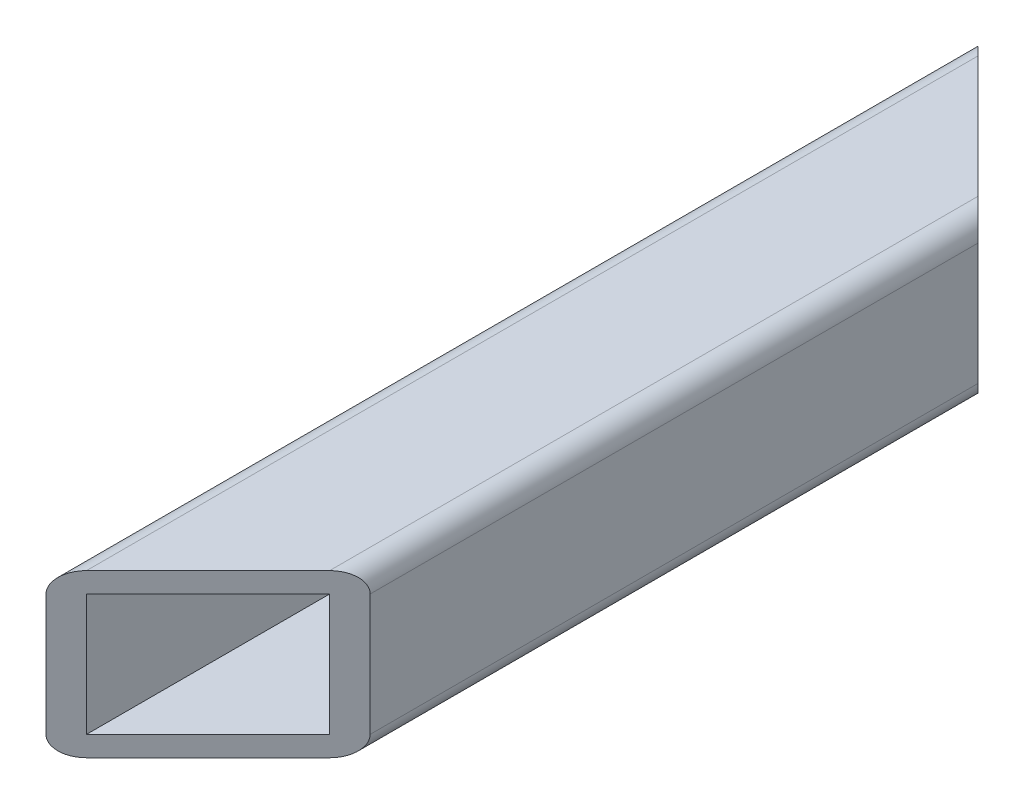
ISO-10303-21;
HEADER;
FILE_DESCRIPTION(('STEP AP214'),'2;1');
FILE_NAME('part.step','',(''),(''),'','','');
FILE_SCHEMA(('AUTOMOTIVE_DESIGN { 1 0 10303 214 1 1 1 1 }'));
ENDSEC;
DATA;
#1=APPLICATION_CONTEXT('core data for automotive mechanical design processes');
#2=APPLICATION_PROTOCOL_DEFINITION('international standard','automotive_design',2000,#1);
#3=PRODUCT_CONTEXT('',#1,'mechanical');
#4=PRODUCT('Part','Part','',(#3));
#5=PRODUCT_RELATED_PRODUCT_CATEGORY('part','',(#4));
#6=PRODUCT_DEFINITION_FORMATION('','',#4);
#7=PRODUCT_DEFINITION_CONTEXT('part definition',#1,'design');
#8=PRODUCT_DEFINITION('design','',#6,#7);
#9=PRODUCT_DEFINITION_SHAPE('','',#8);
#10=(LENGTH_UNIT() NAMED_UNIT(*) SI_UNIT(.MILLI.,.METRE.));
#11=(NAMED_UNIT(*) PLANE_ANGLE_UNIT() SI_UNIT($,.RADIAN.));
#12=(NAMED_UNIT(*) SI_UNIT($,.STERADIAN.) SOLID_ANGLE_UNIT());
#13=UNCERTAINTY_MEASURE_WITH_UNIT(LENGTH_MEASURE(1.E-05),#10,'distance_accuracy_value','');
#14=(GEOMETRIC_REPRESENTATION_CONTEXT(3) GLOBAL_UNCERTAINTY_ASSIGNED_CONTEXT((#13)) GLOBAL_UNIT_ASSIGNED_CONTEXT((#10,
#11,#12)) REPRESENTATION_CONTEXT('',''));
#15=CARTESIAN_POINT('',(0.,0.,0.));
#16=DIRECTION('',(0.,0.,1.));
#17=DIRECTION('',(1.,0.,0.));
#18=AXIS2_PLACEMENT_3D('',#15,#16,#17);
#19=CARTESIAN_POINT('',(-19.0500000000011,-19.05,-292.100000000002));
#20=DIRECTION('',(0.,0.,1.));
#21=DIRECTION('',(1.,0.,0.));
#22=AXIS2_PLACEMENT_3D('',#19,#20,#21);
#23=CYLINDRICAL_SURFACE('',#22,6.35);
#24=CARTESIAN_POINT('',(-19.0500000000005,-19.05,-6.34999999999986));
#25=DIRECTION('',(-0.707106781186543,0.,-0.707106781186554));
#26=DIRECTION('',(-0.707106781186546,0.,0.707106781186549));
#27=AXIS2_PLACEMENT_3D('',#24,#25,#26);
#28=ELLIPSE('',#27,8.98025612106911,6.35);
#29=CARTESIAN_POINT('',(-25.3999999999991,-19.05,0.));
#30=VERTEX_POINT('',#29);
#31=CARTESIAN_POINT('',(-19.0499999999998,-25.4000000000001,-6.34999999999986));
#32=VERTEX_POINT('',#31);
#33=EDGE_CURVE('E220',#30,#32,#28,.F.);
#34=ORIENTED_EDGE('',*,*,#33,.F.);
#35=DIRECTION('',(0.,0.,1.));
#36=VECTOR('',#35,1.);
#37=CARTESIAN_POINT('',(-25.4000000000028,-19.050000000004,-292.100000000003));
#38=LINE('',#37,#36);
#39=CARTESIAN_POINT('',(-25.4000000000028,-19.050000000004,-292.100000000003));
#40=VERTEX_POINT('',#39);
#41=EDGE_CURVE('E173',#40,#30,#38,.T.);
#42=ORIENTED_EDGE('',*,*,#41,.F.);
#43=CARTESIAN_POINT('',(-19.0500000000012,-19.050000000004,-285.750000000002));
#44=DIRECTION('',(-0.707106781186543,0.,0.707106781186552));
#45=DIRECTION('',(0.707106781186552,0.,0.707106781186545));
#46=AXIS2_PLACEMENT_3D('',#43,#44,#45);
#47=ELLIPSE('',#46,8.98025612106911,6.35);
#48=CARTESIAN_POINT('',(-19.0500000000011,-25.4000000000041,-285.750000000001));
#49=VERTEX_POINT('',#48);
#50=EDGE_CURVE('E193',#49,#40,#47,.F.);
#51=ORIENTED_EDGE('',*,*,#50,.F.);
#52=DIRECTION('',(0.,0.,1.));
#53=VECTOR('',#52,1.);
#54=CARTESIAN_POINT('',(-19.0500000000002,-25.4000000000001,-292.100000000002));
#55=LINE('',#54,#53);
#56=EDGE_CURVE('E170',#49,#32,#55,.T.);
#57=ORIENTED_EDGE('',*,*,#56,.T.);
#58=EDGE_LOOP('',(#34,#42,#51,#57));
#59=FACE_BOUND('',#58,.T.);
#60=ADVANCED_FACE('F44',(#59),#23,.T.);
#61=CARTESIAN_POINT('',(-25.4000000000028,-19.050000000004,-292.100000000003));
#62=DIRECTION('',(-1.,0.,0.));
#63=DIRECTION('',(0.,0.,1.));
#64=AXIS2_PLACEMENT_3D('',#61,#62,#63);
#65=PLANE('',#64);
#66=DIRECTION('',(0.,-1.00000000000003,0.));
#67=VECTOR('',#66,1.);
#68=CARTESIAN_POINT('',(-25.3999999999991,-19.05,0.));
#69=LINE('',#68,#67);
#70=CARTESIAN_POINT('',(-25.3999999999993,19.05,6.66133814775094E-13));
#71=VERTEX_POINT('',#70);
#72=EDGE_CURVE('E186',#71,#30,#69,.T.);
#73=ORIENTED_EDGE('',*,*,#72,.F.);
#74=DIRECTION('',(0.,0.,1.));
#75=VECTOR('',#74,1.);
#76=CARTESIAN_POINT('',(-25.4000000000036,19.05,-292.100000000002));
#77=LINE('',#76,#75);
#78=CARTESIAN_POINT('',(-25.4000000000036,19.05,-292.100000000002));
#79=VERTEX_POINT('',#78);
#80=EDGE_CURVE('E159',#79,#71,#77,.T.);
#81=ORIENTED_EDGE('',*,*,#80,.F.);
#82=DIRECTION('',(0.,-1.00000000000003,0.));
#83=VECTOR('',#82,1.);
#84=CARTESIAN_POINT('',(-25.4000000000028,-19.050000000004,-292.100000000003));
#85=LINE('',#84,#83);
#86=EDGE_CURVE('E172',#79,#40,#85,.T.);
#87=ORIENTED_EDGE('',*,*,#86,.T.);
#88=ORIENTED_EDGE('',*,*,#41,.T.);
#89=EDGE_LOOP('',(#73,#81,#87,#88));
#90=FACE_BOUND('',#89,.T.);
#91=ADVANCED_FACE('F255',(#90),#65,.T.);
#92=CARTESIAN_POINT('',(-19.0500000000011,19.05,-292.100000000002));
#93=DIRECTION('',(0.,0.,1.));
#94=DIRECTION('',(1.,0.,0.));
#95=AXIS2_PLACEMENT_3D('',#92,#93,#94);
#96=CYLINDRICAL_SURFACE('',#95,6.35);
#97=CARTESIAN_POINT('',(-19.0500000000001,19.05,-6.34999999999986));
#98=DIRECTION('',(-0.707106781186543,0.,-0.707106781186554));
#99=DIRECTION('',(-0.707106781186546,0.,0.707106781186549));
#100=AXIS2_PLACEMENT_3D('',#97,#98,#99);
#101=ELLIPSE('',#100,8.98025612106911,6.35);
#102=CARTESIAN_POINT('',(-19.0499999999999,25.4000000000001,-6.3500000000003));
#103=VERTEX_POINT('',#102);
#104=EDGE_CURVE('E141',#103,#71,#101,.F.);
#105=ORIENTED_EDGE('',*,*,#104,.F.);
#106=DIRECTION('',(0.,0.,1.));
#107=VECTOR('',#106,1.);
#108=CARTESIAN_POINT('',(-19.0500000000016,25.4000000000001,-292.100000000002));
#109=LINE('',#108,#107);
#110=CARTESIAN_POINT('',(-19.0500000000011,25.4000000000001,-285.750000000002));
#111=VERTEX_POINT('',#110);
#112=EDGE_CURVE('E151',#111,#103,#109,.T.);
#113=ORIENTED_EDGE('',*,*,#112,.F.);
#114=CARTESIAN_POINT('',(-19.0500000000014,19.05,-285.750000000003));
#115=DIRECTION('',(-0.707106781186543,0.,0.707106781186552));
#116=DIRECTION('',(0.707106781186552,0.,0.707106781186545));
#117=AXIS2_PLACEMENT_3D('',#114,#115,#116);
#118=ELLIPSE('',#117,8.98025612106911,6.35);
#119=EDGE_CURVE('E202',#79,#111,#118,.F.);
#120=ORIENTED_EDGE('',*,*,#119,.F.);
#121=ORIENTED_EDGE('',*,*,#80,.T.);
#122=EDGE_LOOP('',(#105,#113,#120,#121));
#123=FACE_BOUND('',#122,.T.);
#124=ADVANCED_FACE('F253',(#123),#96,.T.);
#125=CARTESIAN_POINT('',(-19.0500000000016,25.4000000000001,-292.100000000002));
#126=DIRECTION('',(0.,1.00000000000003,0.));
#127=DIRECTION('',(0.,0.,1.));
#128=AXIS2_PLACEMENT_3D('',#125,#126,#127);
#129=PLANE('',#128);
#130=DIRECTION('',(-0.707106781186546,0.,0.707106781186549));
#131=VECTOR('',#130,1.);
#132=CARTESIAN_POINT('',(-25.3999999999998,25.4000000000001,0.));
#133=LINE('',#132,#131);
#134=CARTESIAN_POINT('',(19.0499999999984,25.4000000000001,-44.4499999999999));
#135=VERTEX_POINT('',#134);
#136=EDGE_CURVE('E133',#135,#103,#133,.T.);
#137=ORIENTED_EDGE('',*,*,#136,.F.);
#138=DIRECTION('',(0.,0.,1.));
#139=VECTOR('',#138,1.);
#140=CARTESIAN_POINT('',(19.0499999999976,25.4000000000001,-292.100000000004));
#141=LINE('',#140,#139);
#142=CARTESIAN_POINT('',(19.0499999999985,25.3999999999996,-247.650000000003));
#143=VERTEX_POINT('',#142);
#144=EDGE_CURVE('E149',#143,#135,#141,.T.);
#145=ORIENTED_EDGE('',*,*,#144,.F.);
#146=DIRECTION('',(0.707106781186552,0.,0.707106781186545));
#147=VECTOR('',#146,1.);
#148=CARTESIAN_POINT('',(-25.4000000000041,25.4000000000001,-292.100000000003));
#149=LINE('',#148,#147);
#150=EDGE_CURVE('E218',#111,#143,#149,.T.);
#151=ORIENTED_EDGE('',*,*,#150,.F.);
#152=ORIENTED_EDGE('',*,*,#112,.T.);
#153=EDGE_LOOP('',(#137,#145,#151,#152));
#154=FACE_BOUND('',#153,.T.);
#155=ADVANCED_FACE('F147',(#154),#129,.T.);
#156=CARTESIAN_POINT('',(19.0499999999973,19.05,-292.100000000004));
#157=DIRECTION('',(0.,0.,1.));
#158=DIRECTION('',(1.,0.,0.));
#159=AXIS2_PLACEMENT_3D('',#156,#157,#158);
#160=CYLINDRICAL_SURFACE('',#159,6.35);
#161=CARTESIAN_POINT('',(19.0499999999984,19.05,-44.4499999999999));
#162=DIRECTION('',(-0.707106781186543,0.,-0.707106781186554));
#163=DIRECTION('',(-0.707106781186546,0.,0.707106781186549));
#164=AXIS2_PLACEMENT_3D('',#161,#162,#163);
#165=ELLIPSE('',#164,8.98025612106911,6.35);
#166=CARTESIAN_POINT('',(25.3999999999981,19.05,-50.7999999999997));
#167=VERTEX_POINT('',#166);
#168=EDGE_CURVE('E130',#167,#135,#165,.F.);
#169=ORIENTED_EDGE('',*,*,#168,.F.);
#170=DIRECTION('',(0.,0.,1.));
#171=VECTOR('',#170,1.);
#172=CARTESIAN_POINT('',(25.3999999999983,19.05,-292.100000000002));
#173=LINE('',#172,#171);
#174=CARTESIAN_POINT('',(25.3999999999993,19.0499999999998,-241.300000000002));
#175=VERTEX_POINT('',#174);
#176=EDGE_CURVE('E157',#175,#167,#173,.T.);
#177=ORIENTED_EDGE('',*,*,#176,.F.);
#178=CARTESIAN_POINT('',(19.0499999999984,19.049999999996,-247.650000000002));
#179=DIRECTION('',(-0.707106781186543,0.,0.707106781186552));
#180=DIRECTION('',(0.707106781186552,0.,0.707106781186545));
#181=AXIS2_PLACEMENT_3D('',#178,#179,#180);
#182=ELLIPSE('',#181,8.98025612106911,6.35);
#183=EDGE_CURVE('E156',#143,#175,#182,.F.);
#184=ORIENTED_EDGE('',*,*,#183,.F.);
#185=ORIENTED_EDGE('',*,*,#144,.T.);
#186=EDGE_LOOP('',(#169,#177,#184,#185));
#187=FACE_BOUND('',#186,.T.);
#188=ADVANCED_FACE('F155',(#187),#160,.T.);
#189=CARTESIAN_POINT('',(25.3999999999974,-19.05,-292.100000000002));
#190=DIRECTION('',(1.,0.,0.));
#191=DIRECTION('',(0.,0.,-1.));
#192=AXIS2_PLACEMENT_3D('',#189,#190,#191);
#193=PLANE('',#192);
#194=DIRECTION('',(0.,1.00000000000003,0.));
#195=VECTOR('',#194,1.);
#196=CARTESIAN_POINT('',(25.4000000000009,-25.4000000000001,-50.7999999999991));
#197=LINE('',#196,#195);
#198=CARTESIAN_POINT('',(25.3999999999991,-19.05,-50.7999999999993));
#199=VERTEX_POINT('',#198);
#200=EDGE_CURVE('E136',#199,#167,#197,.T.);
#201=ORIENTED_EDGE('',*,*,#200,.F.);
#202=DIRECTION('',(0.,0.,1.));
#203=VECTOR('',#202,1.);
#204=CARTESIAN_POINT('',(25.3999999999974,-19.05,-292.100000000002));
#205=LINE('',#204,#203);
#206=CARTESIAN_POINT('',(25.3999999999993,-19.050000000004,-241.300000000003));
#207=VERTEX_POINT('',#206);
#208=EDGE_CURVE('E161',#207,#199,#205,.T.);
#209=ORIENTED_EDGE('',*,*,#208,.F.);
#210=DIRECTION('',(0.,1.00000000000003,0.));
#211=VECTOR('',#210,1.);
#212=CARTESIAN_POINT('',(25.3999999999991,-25.4000000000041,-241.300000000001));
#213=LINE('',#212,#211);
#214=EDGE_CURVE('E214',#207,#175,#213,.T.);
#215=ORIENTED_EDGE('',*,*,#214,.T.);
#216=ORIENTED_EDGE('',*,*,#176,.T.);
#217=EDGE_LOOP('',(#201,#209,#215,#216));
#218=FACE_BOUND('',#217,.T.);
#219=ADVANCED_FACE('F251',(#218),#193,.T.);
#220=CARTESIAN_POINT('',(19.049999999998,-19.05,-292.100000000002));
#221=DIRECTION('',(0.,0.,1.));
#222=DIRECTION('',(1.,0.,0.));
#223=AXIS2_PLACEMENT_3D('',#220,#221,#222);
#224=CYLINDRICAL_SURFACE('',#223,6.35);
#225=CARTESIAN_POINT('',(19.0499999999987,-19.05,-44.4500000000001));
#226=DIRECTION('',(-0.707106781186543,0.,-0.707106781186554));
#227=DIRECTION('',(-0.707106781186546,0.,0.707106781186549));
#228=AXIS2_PLACEMENT_3D('',#225,#226,#227);
#229=ELLIPSE('',#228,8.98025612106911,6.35);
#230=CARTESIAN_POINT('',(19.0499999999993,-25.4000000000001,-44.4499999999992));
#231=VERTEX_POINT('',#230);
#232=EDGE_CURVE('E142',#231,#199,#229,.F.);
#233=ORIENTED_EDGE('',*,*,#232,.F.);
#234=DIRECTION('',(0.,0.,1.));
#235=VECTOR('',#234,1.);
#236=CARTESIAN_POINT('',(19.0499999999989,-25.3999999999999,-292.100000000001));
#237=LINE('',#236,#235);
#238=CARTESIAN_POINT('',(19.049999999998,-25.4000000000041,-247.650000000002));
#239=VERTEX_POINT('',#238);
#240=EDGE_CURVE('E167',#239,#231,#237,.T.);
#241=ORIENTED_EDGE('',*,*,#240,.F.);
#242=CARTESIAN_POINT('',(19.0499999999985,-19.050000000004,-247.650000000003));
#243=DIRECTION('',(-0.707106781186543,0.,0.707106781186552));
#244=DIRECTION('',(0.707106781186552,0.,0.707106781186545));
#245=AXIS2_PLACEMENT_3D('',#242,#243,#244);
#246=ELLIPSE('',#245,8.98025612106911,6.35);
#247=EDGE_CURVE('E205',#207,#239,#246,.F.);
#248=ORIENTED_EDGE('',*,*,#247,.F.);
#249=ORIENTED_EDGE('',*,*,#208,.T.);
#250=EDGE_LOOP('',(#233,#241,#248,#249));
#251=FACE_BOUND('',#250,.T.);
#252=ADVANCED_FACE('F248',(#251),#224,.T.);
#253=CARTESIAN_POINT('',(-19.0500000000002,-25.4000000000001,-292.100000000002));
#254=DIRECTION('',(0.,-1.00000000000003,0.));
#255=DIRECTION('',(0.,0.,-1.));
#256=AXIS2_PLACEMENT_3D('',#253,#254,#255);
#257=PLANE('',#256);
#258=DIRECTION('',(-0.707106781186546,0.,0.707106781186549));
#259=VECTOR('',#258,1.);
#260=CARTESIAN_POINT('',(-25.3999999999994,-25.4000000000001,4.44089209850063E-13));
#261=LINE('',#260,#259);
#262=EDGE_CURVE('E152',#231,#32,#261,.T.);
#263=ORIENTED_EDGE('',*,*,#262,.T.);
#264=ORIENTED_EDGE('',*,*,#56,.F.);
#265=DIRECTION('',(0.707106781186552,0.,0.707106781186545));
#266=VECTOR('',#265,1.);
#267=CARTESIAN_POINT('',(-25.400000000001,-25.4000000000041,-292.100000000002));
#268=LINE('',#267,#266);
#269=EDGE_CURVE('E217',#49,#239,#268,.T.);
#270=ORIENTED_EDGE('',*,*,#269,.T.);
#271=ORIENTED_EDGE('',*,*,#240,.T.);
#272=EDGE_LOOP('',(#263,#264,#270,#271));
#273=FACE_BOUND('',#272,.T.);
#274=ADVANCED_FACE('F237',(#273),#257,.T.);
#275=CARTESIAN_POINT('',(-19.0500000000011,-19.05,-292.100000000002));
#276=DIRECTION('',(0.,-1.00000000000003,0.));
#277=DIRECTION('',(0.,0.,-1.));
#278=AXIS2_PLACEMENT_3D('',#275,#276,#277);
#279=PLANE('',#278);
#280=DIRECTION('',(0.,0.,1.));
#281=VECTOR('',#280,1.);
#282=CARTESIAN_POINT('',(-19.0500000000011,-19.05,-292.100000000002));
#283=LINE('',#282,#281);
#284=CARTESIAN_POINT('',(-19.0500000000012,-19.050000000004,-285.750000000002));
#285=VERTEX_POINT('',#284);
#286=CARTESIAN_POINT('',(-19.0500000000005,-19.05,-6.34999999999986));
#287=VERTEX_POINT('',#286);
#288=EDGE_CURVE('E188',#285,#287,#283,.T.);
#289=ORIENTED_EDGE('',*,*,#288,.T.);
#290=DIRECTION('',(0.707106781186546,0.,-0.707106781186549));
#291=VECTOR('',#290,1.);
#292=CARTESIAN_POINT('',(123.824999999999,-19.05,-149.225));
#293=LINE('',#292,#291);
#294=CARTESIAN_POINT('',(19.0499999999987,-19.05,-44.4500000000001));
#295=VERTEX_POINT('',#294);
#296=EDGE_CURVE('E226',#287,#295,#293,.T.);
#297=ORIENTED_EDGE('',*,*,#296,.T.);
#298=DIRECTION('',(0.,0.,1.));
#299=VECTOR('',#298,1.);
#300=CARTESIAN_POINT('',(19.049999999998,-19.05,-292.100000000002));
#301=LINE('',#300,#299);
#302=CARTESIAN_POINT('',(19.0499999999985,-19.050000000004,-247.650000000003));
#303=VERTEX_POINT('',#302);
#304=EDGE_CURVE('E190',#303,#295,#301,.T.);
#305=ORIENTED_EDGE('',*,*,#304,.F.);
#306=DIRECTION('',(-0.707106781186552,0.,-0.707106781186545));
#307=VECTOR('',#306,1.);
#308=CARTESIAN_POINT('',(-22.2250000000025,-19.050000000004,-288.925000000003));
#309=LINE('',#308,#307);
#310=EDGE_CURVE('E65',#303,#285,#309,.T.);
#311=ORIENTED_EDGE('',*,*,#310,.T.);
#312=EDGE_LOOP('',(#289,#297,#305,#311));
#313=FACE_BOUND('',#312,.T.);
#314=ADVANCED_FACE('F264',(#313),#279,.F.);
#315=CARTESIAN_POINT('',(-19.0500000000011,-19.05,-292.100000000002));
#316=DIRECTION('',(-1.,0.,0.));
#317=DIRECTION('',(0.,0.,1.));
#318=AXIS2_PLACEMENT_3D('',#315,#316,#317);
#319=PLANE('',#318);
#320=DIRECTION('',(0.,0.,1.));
#321=VECTOR('',#320,1.);
#322=CARTESIAN_POINT('',(-19.0500000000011,19.05,-292.100000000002));
#323=LINE('',#322,#321);
#324=CARTESIAN_POINT('',(-19.0500000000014,19.05,-285.750000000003));
#325=VERTEX_POINT('',#324);
#326=CARTESIAN_POINT('',(-19.0500000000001,19.05,-6.34999999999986));
#327=VERTEX_POINT('',#326);
#328=EDGE_CURVE('E196',#325,#327,#323,.T.);
#329=ORIENTED_EDGE('',*,*,#328,.T.);
#330=DIRECTION('',(0.,-1.00000000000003,0.));
#331=VECTOR('',#330,1.);
#332=CARTESIAN_POINT('',(-19.0500000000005,-19.05,-6.34999999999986));
#333=LINE('',#332,#331);
#334=EDGE_CURVE('E229',#327,#287,#333,.T.);
#335=ORIENTED_EDGE('',*,*,#334,.T.);
#336=ORIENTED_EDGE('',*,*,#288,.F.);
#337=DIRECTION('',(0.,1.00000000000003,0.));
#338=VECTOR('',#337,1.);
#339=CARTESIAN_POINT('',(-19.0500000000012,-19.050000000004,-285.750000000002));
#340=LINE('',#339,#338);
#341=EDGE_CURVE('E208',#285,#325,#340,.T.);
#342=ORIENTED_EDGE('',*,*,#341,.T.);
#343=EDGE_LOOP('',(#329,#335,#336,#342));
#344=FACE_BOUND('',#343,.T.);
#345=ADVANCED_FACE('F278',(#344),#319,.F.);
#346=CARTESIAN_POINT('',(-19.0500000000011,19.05,-292.100000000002));
#347=DIRECTION('',(0.,1.00000000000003,0.));
#348=DIRECTION('',(-1.,0.,0.));
#349=AXIS2_PLACEMENT_3D('',#346,#347,#348);
#350=PLANE('',#349);
#351=DIRECTION('',(0.,0.,1.));
#352=VECTOR('',#351,1.);
#353=CARTESIAN_POINT('',(19.0499999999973,19.05,-292.100000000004));
#354=LINE('',#353,#352);
#355=CARTESIAN_POINT('',(19.0499999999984,19.049999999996,-247.650000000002));
#356=VERTEX_POINT('',#355);
#357=CARTESIAN_POINT('',(19.0499999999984,19.05,-44.4499999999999));
#358=VERTEX_POINT('',#357);
#359=EDGE_CURVE('E192',#356,#358,#354,.T.);
#360=ORIENTED_EDGE('',*,*,#359,.T.);
#361=DIRECTION('',(-0.707106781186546,0.,0.707106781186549));
#362=VECTOR('',#361,1.);
#363=CARTESIAN_POINT('',(123.825,19.0500000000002,-149.224999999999));
#364=LINE('',#363,#362);
#365=EDGE_CURVE('E58',#358,#327,#364,.T.);
#366=ORIENTED_EDGE('',*,*,#365,.T.);
#367=ORIENTED_EDGE('',*,*,#328,.F.);
#368=DIRECTION('',(0.707106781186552,0.,0.707106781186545));
#369=VECTOR('',#368,1.);
#370=CARTESIAN_POINT('',(-22.2250000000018,19.05,-288.925000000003));
#371=LINE('',#370,#369);
#372=EDGE_CURVE('E211',#325,#356,#371,.T.);
#373=ORIENTED_EDGE('',*,*,#372,.T.);
#374=EDGE_LOOP('',(#360,#366,#367,#373));
#375=FACE_BOUND('',#374,.T.);
#376=ADVANCED_FACE('F283',(#375),#350,.F.);
#377=CARTESIAN_POINT('',(19.049999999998,-19.05,-292.100000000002));
#378=DIRECTION('',(1.,0.,0.));
#379=DIRECTION('',(0.,1.00000000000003,0.));
#380=AXIS2_PLACEMENT_3D('',#377,#378,#379);
#381=PLANE('',#380);
#382=ORIENTED_EDGE('',*,*,#304,.T.);
#383=DIRECTION('',(0.,1.00000000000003,0.));
#384=VECTOR('',#383,1.);
#385=CARTESIAN_POINT('',(19.0499999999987,-19.0500000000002,-44.4500000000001));
#386=LINE('',#385,#384);
#387=EDGE_CURVE('E13',#295,#358,#386,.T.);
#388=ORIENTED_EDGE('',*,*,#387,.T.);
#389=ORIENTED_EDGE('',*,*,#359,.F.);
#390=DIRECTION('',(0.,-1.00000000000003,0.));
#391=VECTOR('',#390,1.);
#392=CARTESIAN_POINT('',(19.0499999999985,-19.0500000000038,-247.650000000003));
#393=LINE('',#392,#391);
#394=EDGE_CURVE('E51',#356,#303,#393,.T.);
#395=ORIENTED_EDGE('',*,*,#394,.T.);
#396=EDGE_LOOP('',(#382,#388,#389,#395));
#397=FACE_BOUND('',#396,.T.);
#398=ADVANCED_FACE('F289',(#397),#381,.F.);
#399=CARTESIAN_POINT('',(-25.400000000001,-25.4000000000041,-292.100000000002));
#400=DIRECTION('',(-0.707106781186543,0.,0.707106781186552));
#401=DIRECTION('',(0.707106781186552,0.,0.707106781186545));
#402=AXIS2_PLACEMENT_3D('',#399,#400,#401);
#403=PLANE('',#402);
#404=ORIENTED_EDGE('',*,*,#50,.T.);
#405=ORIENTED_EDGE('',*,*,#86,.F.);
#406=ORIENTED_EDGE('',*,*,#119,.T.);
#407=ORIENTED_EDGE('',*,*,#150,.T.);
#408=ORIENTED_EDGE('',*,*,#183,.T.);
#409=ORIENTED_EDGE('',*,*,#214,.F.);
#410=ORIENTED_EDGE('',*,*,#247,.T.);
#411=ORIENTED_EDGE('',*,*,#269,.F.);
#412=EDGE_LOOP('',(#404,#405,#406,#407,#408,#409,#410,#411));
#413=FACE_BOUND('',#412,.T.);
#414=ORIENTED_EDGE('',*,*,#394,.F.);
#415=ORIENTED_EDGE('',*,*,#372,.F.);
#416=ORIENTED_EDGE('',*,*,#341,.F.);
#417=ORIENTED_EDGE('',*,*,#310,.F.);
#418=EDGE_LOOP('',(#414,#415,#416,#417));
#419=FACE_BOUND('',#418,.T.);
#420=ADVANCED_FACE('F244',(#413,#419),#403,.F.);
#421=CARTESIAN_POINT('',(-25.3999999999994,-25.4000000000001,4.44089209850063E-13));
#422=DIRECTION('',(-0.707106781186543,0.,-0.707106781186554));
#423=DIRECTION('',(-0.707106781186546,0.,0.707106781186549));
#424=AXIS2_PLACEMENT_3D('',#421,#422,#423);
#425=PLANE('',#424);
#426=ORIENTED_EDGE('',*,*,#33,.T.);
#427=ORIENTED_EDGE('',*,*,#262,.F.);
#428=ORIENTED_EDGE('',*,*,#232,.T.);
#429=ORIENTED_EDGE('',*,*,#200,.T.);
#430=ORIENTED_EDGE('',*,*,#168,.T.);
#431=ORIENTED_EDGE('',*,*,#136,.T.);
#432=ORIENTED_EDGE('',*,*,#104,.T.);
#433=ORIENTED_EDGE('',*,*,#72,.T.);
#434=EDGE_LOOP('',(#426,#427,#428,#429,#430,#431,#432,#433));
#435=FACE_BOUND('',#434,.T.);
#436=ORIENTED_EDGE('',*,*,#334,.F.);
#437=ORIENTED_EDGE('',*,*,#365,.F.);
#438=ORIENTED_EDGE('',*,*,#387,.F.);
#439=ORIENTED_EDGE('',*,*,#296,.F.);
#440=EDGE_LOOP('',(#436,#437,#438,#439));
#441=FACE_BOUND('',#440,.T.);
#442=ADVANCED_FACE('F132',(#435,#441),#425,.F.);
#443=CLOSED_SHELL('',(#60,#91,#124,#155,#188,#219,#252,#274,#314,#345,#376,#398,#420,#442));
#444=MANIFOLD_SOLID_BREP('B2',#443);
#445=ADVANCED_BREP_SHAPE_REPRESENTATION('',(#18,#444),#14);
#446=SHAPE_DEFINITION_REPRESENTATION(#9,#445);
ENDSEC;
END-ISO-10303-21;
